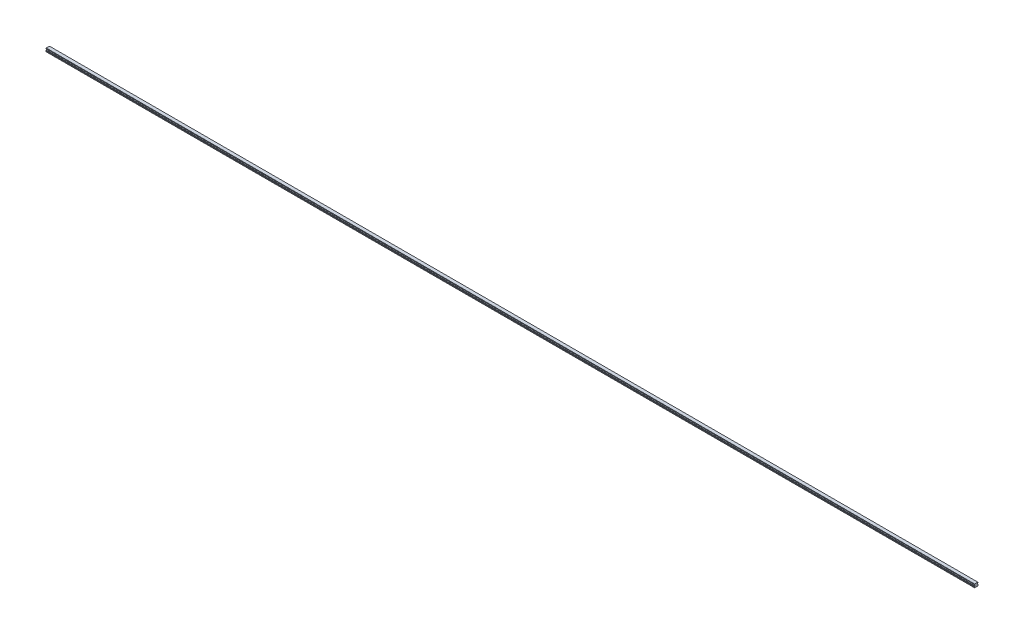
from build123d import *

# Parameters (mm, degrees)
BOSS_EXTRUDE1_DEPTH        = 3780
SKETCH3_R                  = 2.5
SKETCH3_R_2                = 2.1
CUT_EXTRUDE3_DEPTH         = 7
SKETCH3_2_R                = 2.1
CUT_EXTRUDE4_DEPTH         = 9.5
CHAMFER1_SIZE              = 0.4
LPATTERN2_COUNT            = 63
LPATTERN2_PITCH            = 60
CHAMFER1_OF_LPATTERN2_SIZE = 0.4


with BuildPart() as part:
    # Sketch1 → Boss-Extrude1 (new body)
    with BuildSketch(Plane(origin=(0, 0, 0), x_dir=(0, 0, -1), z_dir=(1, 0, 0))):
        with BuildLine():
            Line((6.59, 14), (-6.59, 14))
            Line((-6.59, 14), (-6.59, 13.15))
            Line((-6.59, 13.15), (-6.96, 12.356532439))
            Line((-6.96, 12.356532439), (-6.96, 11.435174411))
            ThreePointArc((-6.96, 11.435174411), (-5.25, 9.5), (-6.96, 7.564825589))
            Line((-6.96, 7.564825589), (-6.96, 6.643467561))
            Line((-6.96, 6.643467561), (-6.59, 5.85))
            Line((-6.59, 5.85), (-7.032116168, 4.2))
            Line((-7.032116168, 4.2), (-7.5, 3.929867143))
            Line((-7.5, 3.929867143), (-7.5, 1.4))
            Line((-7.5, 1.4), (-6.1, 0))
            Line((-6.1, 0), (-3.65, 0))
            Line((-3.65, 0), (-3.25, 0.4))
            Line((-3.25, 0.4), (3.25, 0.4))
            Line((3.25, 0.4), (3.65, 0))
            Line((3.65, 0), (6.1, 0))
            Line((6.1, 0), (7.5, 1.4))
            Line((7.5, 1.4), (7.5, 3.929867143))
            Line((7.5, 3.929867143), (7.032116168, 4.2))
            Line((7.032116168, 4.2), (6.59, 5.85))
            Line((6.59, 5.85), (6.96, 6.643467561))
            Line((6.96, 6.643467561), (6.96, 7.564825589))
            ThreePointArc((6.96, 7.564825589), (5.25, 9.5), (6.96, 11.435174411))
            Line((6.96, 11.435174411), (6.96, 12.356532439))
            Line((6.96, 12.356532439), (6.59, 13.15))
            Line((6.59, 13.15), (6.59, 14))
        make_face()
    extrude(amount=BOSS_EXTRUDE1_DEPTH)

    # Sketch3 → Cut-Extrude3 (cut)
    with BuildSketch(Plane.XZ):
        with Locations(Location((30, 0, 0), (0, 0, 270))):
            Circle(SKETCH3_R)
        with Locations(Location((30, 0, 0), (0, 0, 270))):
            Circle(SKETCH3_R_2, mode=Mode.SUBTRACT)
    cut_extrude3 = extrude(amount=-CUT_EXTRUDE3_DEPTH, mode=Mode.SUBTRACT)

    # Sketch3_2 → Cut-Extrude4 (cut)
    with BuildSketch(Plane.XZ):
        with Locations(Location((30, 0, 0), (0, 0, 270))):
            Circle(SKETCH3_2_R)
    cut_extrude4 = extrude(amount=-CUT_EXTRUDE4_DEPTH, mode=Mode.SUBTRACT)

    # Cut-Extrude5 cone 1 section (on through the dimple's axis) → Cut-Extrude5 (revolve, cut)
    with BuildSketch(Plane(origin=(30, 9.5, 0), x_dir=(0, 0, -1), z_dir=(1, 0, 0))):
        Polygon((0, 0), (2.1, 0), (0, 1.212435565), align=None)
    revolve(axis=Axis((30, 9.5, 0), (0, 1, 0)), mode=Mode.SUBTRACT)

    # Chamfer1
    chamfer1_edges = [part.edges().sort_by_distance(p)[0] for p in [
        (30, 0.4, 2.5),
    ]]
    chamfer(chamfer1_edges, length=CHAMFER1_SIZE)

    # LPattern2: Cut-Extrude3, Cut-Extrude4 ×63
    with Locations(*[(i * LPATTERN2_PITCH, 0, 0) for i in range(1, LPATTERN2_COUNT)]):
        add(cut_extrude3, mode=Mode.SUBTRACT)
        add(cut_extrude4, mode=Mode.SUBTRACT)

    # Chamfer1 of LPattern2
    chamfer1_of_lpattern2_edges = [part.edges().sort_by_distance(p)[0] for p in [
        (90, 0.4, 2.5),
        (150, 0.4, 2.5),
        (210, 0.4, 2.5),
        (270, 0.4, 2.5),
        (330, 0.4, 2.5),
        (390, 0.4, 2.5),
        (450, 0.4, 2.5),
        (510, 0.4, 2.5),
        (570, 0.4, 2.5),
        (630, 0.4, 2.5),
        (690, 0.4, 2.5),
        (750, 0.4, 2.5),
        (810, 0.4, 2.5),
        (870, 0.4, 2.5),
        (930, 0.4, 2.5),
        (990, 0.4, 2.5),
        (1050, 0.4, 2.5),
        (1110, 0.4, 2.5),
        (1170, 0.4, 2.5),
        (1230, 0.4, 2.5),
        (1290, 0.4, 2.5),
        (1350, 0.4, 2.5),
        (1410, 0.4, 2.5),
        (1470, 0.4, 2.5),
        (1530, 0.4, 2.5),
        (1590, 0.4, 2.5),
        (1650, 0.4, 2.5),
        (1710, 0.4, 2.5),
        (1770, 0.4, 2.5),
        (1830, 0.4, 2.5),
        (1890, 0.4, 2.5),
        (1950, 0.4, 2.5),
        (2010, 0.4, 2.5),
        (2070, 0.4, 2.5),
        (2130, 0.4, 2.5),
        (2190, 0.4, 2.5),
        (2250, 0.4, 2.5),
        (2310, 0.4, 2.5),
        (2370, 0.4, 2.5),
        (2430, 0.4, 2.5),
        (2490, 0.4, 2.5),
        (2550, 0.4, 2.5),
        (2610, 0.4, 2.5),
        (2670, 0.4, 2.5),
        (2730, 0.4, 2.5),
        (2790, 0.4, 2.5),
        (2850, 0.4, 2.5),
        (2910, 0.4, 2.5),
        (2970, 0.4, 2.5),
        (3030, 0.4, 2.5),
        (3090, 0.4, 2.5),
        (3150, 0.4, 2.5),
        (3210, 0.4, 2.5),
        (3270, 0.4, 2.5),
        (3330, 0.4, 2.5),
        (3390, 0.4, 2.5),
        (3450, 0.4, 2.5),
        (3510, 0.4, 2.5),
        (3570, 0.4, 2.5),
        (3630, 0.4, 2.5),
        (3690, 0.4, 2.5),
        (3750, 0.4, 2.5),
    ]]
    chamfer(chamfer1_of_lpattern2_edges, length=CHAMFER1_OF_LPATTERN2_SIZE)


solid = part.part
